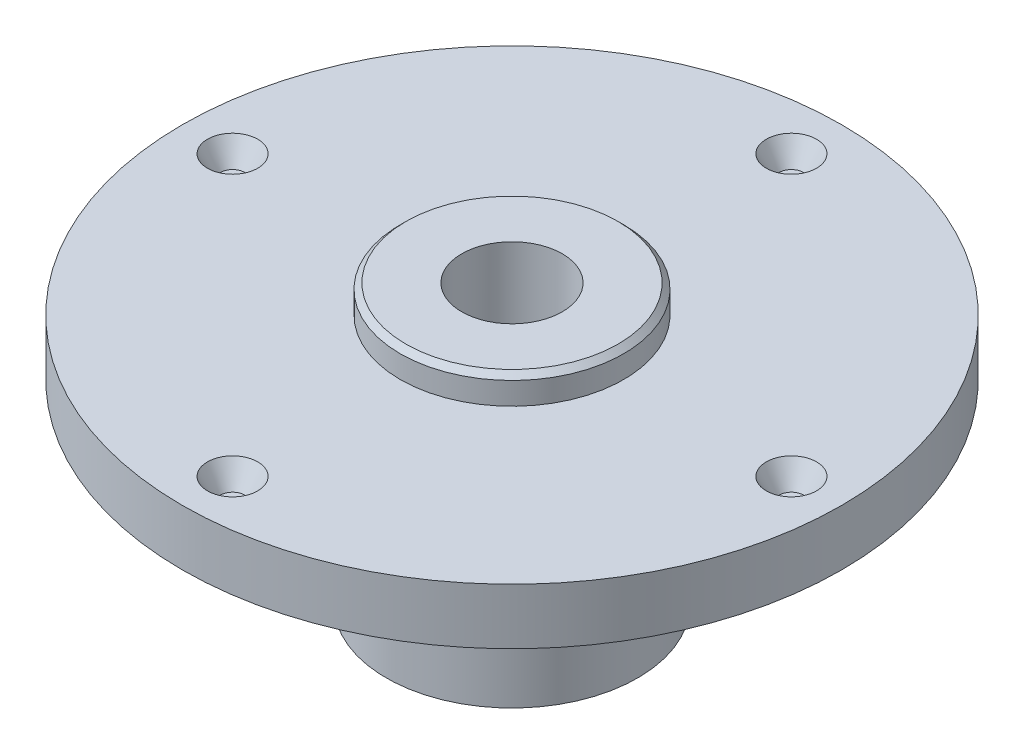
from build123d import *

# Parameters (mm, degrees)
R_P_TITION_CIRCULAIRE1_COUNT = 4
ESQUISSE3_R                  = 2.5
ENL_V_MAT_EXTRU_1_DEPTH      = 22.5
CHANFREIN1_SIZE              = 1


with BuildPart() as part:
    # Esquisse1 → Base-R_volution (revolve)
    with BuildSketch(Plane.XY, mode=Mode.PRIVATE) as base_r_volution_sk:
        Polygon((9, 0), (22.5, 0), (22.5, 35), (59, 35), (59, 45), (20, 45), (20, 50), (9, 50), align=None)
    revolve(base_r_volution_sk.sketch.rotate(Axis((0, 0, 0), (0, 1, 0)), 90), axis=Axis((0, 0, 0), (0, 1, 0)))

    # Esquisse2 → Enlever de la mati_re-R_volution1 (revolve, cut)
    with BuildSketch(Plane.XY, mode=Mode.PRIVATE) as enlever_de_la_mati_re_r_volution1_sk:
        Polygon((50, 45), (45.5, 45), (47.809401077, 41), (50, 41), align=None)
    enlever_de_la_mati_re_r_volution1 = revolve(enlever_de_la_mati_re_r_volution1_sk.sketch.rotate(Axis((50, 50.797703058, 0), (0, -1, 0)), 270), axis=Axis((50, 50.797703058, 0), (0, -1, 0)), mode=Mode.SUBTRACT)

    # R_p_tition circulaire1: Enlever de la mati_re-R_volution1 ×4 about axis
    r_p_tition_circulaire1_axis = Axis((0, 0, 0), (0, 1, 0))
    for i in range(1, R_P_TITION_CIRCULAIRE1_COUNT):
        add(enlever_de_la_mati_re_r_volution1.rotate(r_p_tition_circulaire1_axis, i * 360 / R_P_TITION_CIRCULAIRE1_COUNT), mode=Mode.SUBTRACT)

    # Esquisse3 → Enl_v. mat.-Extru.1 (cut, symmetric)
    with BuildSketch(Plane(origin=(0, 0, 0), x_dir=(0, 0, -1), z_dir=(1, 0, 0))):
        with Locations((0, 15)):
            Circle(ESQUISSE3_R)
    extrude(amount=ENL_V_MAT_EXTRU_1_DEPTH, both=True, mode=Mode.SUBTRACT)

    # Chanfrein1
    chanfrein1_edges = [part.edges().sort_by_distance(p)[0] for p in [
        (0, 50, 20),
    ]]
    chamfer(chanfrein1_edges, length=CHANFREIN1_SIZE)


solid = part.part
